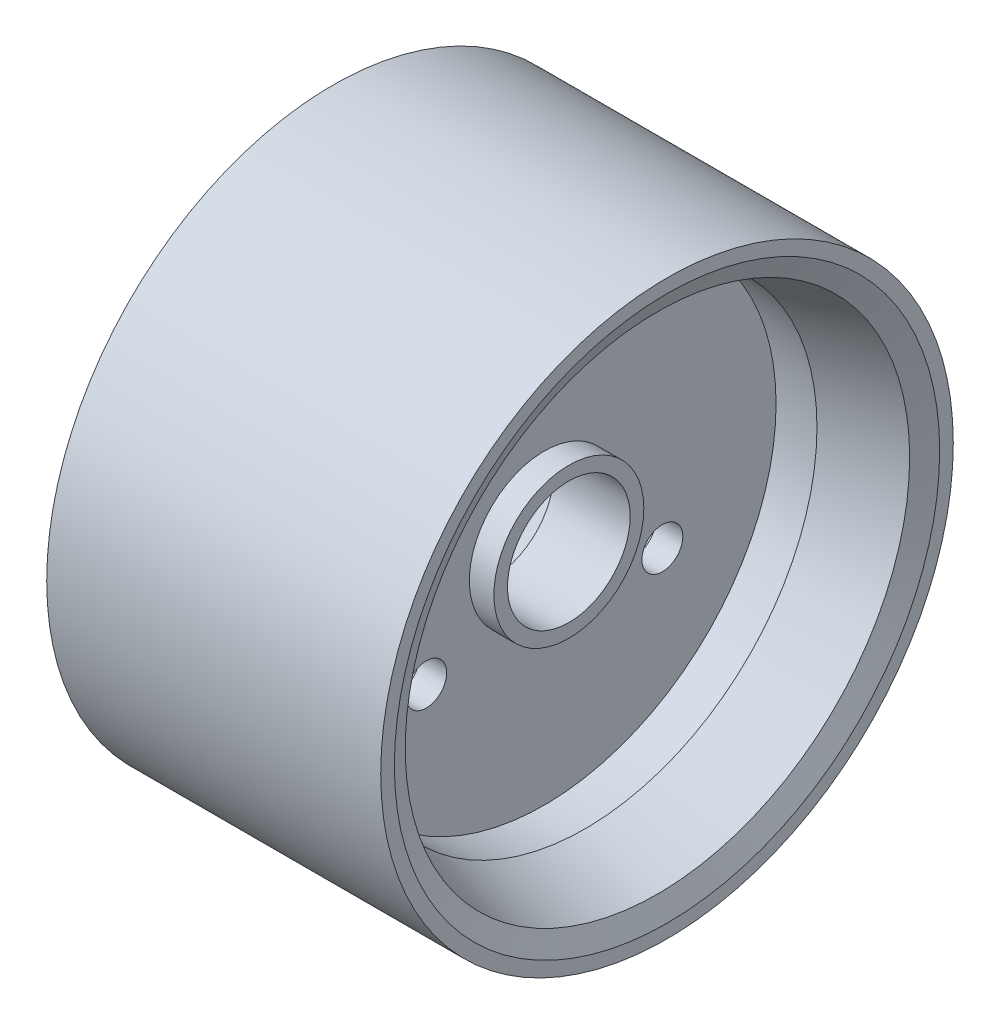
ISO-10303-21;
HEADER;
FILE_DESCRIPTION(('STEP AP214'),'2;1');
FILE_NAME('part.step','',(''),(''),'','','');
FILE_SCHEMA(('AUTOMOTIVE_DESIGN { 1 0 10303 214 1 1 1 1 }'));
ENDSEC;
DATA;
#1=APPLICATION_CONTEXT('core data for automotive mechanical design processes');
#2=APPLICATION_PROTOCOL_DEFINITION('international standard','automotive_design',2000,#1);
#3=PRODUCT_CONTEXT('',#1,'mechanical');
#4=PRODUCT('Part','Part','',(#3));
#5=PRODUCT_RELATED_PRODUCT_CATEGORY('part','',(#4));
#6=PRODUCT_DEFINITION_FORMATION('','',#4);
#7=PRODUCT_DEFINITION_CONTEXT('part definition',#1,'design');
#8=PRODUCT_DEFINITION('design','',#6,#7);
#9=PRODUCT_DEFINITION_SHAPE('','',#8);
#10=(LENGTH_UNIT() NAMED_UNIT(*) SI_UNIT(.MILLI.,.METRE.));
#11=(NAMED_UNIT(*) PLANE_ANGLE_UNIT() SI_UNIT($,.RADIAN.));
#12=(NAMED_UNIT(*) SI_UNIT($,.STERADIAN.) SOLID_ANGLE_UNIT());
#13=UNCERTAINTY_MEASURE_WITH_UNIT(LENGTH_MEASURE(1.E-05),#10,'distance_accuracy_value','');
#14=(GEOMETRIC_REPRESENTATION_CONTEXT(3) GLOBAL_UNCERTAINTY_ASSIGNED_CONTEXT((#13)) GLOBAL_UNIT_ASSIGNED_CONTEXT((#10,
#11,#12)) REPRESENTATION_CONTEXT('',''));
#15=CARTESIAN_POINT('',(0.,0.,0.));
#16=DIRECTION('',(0.,0.,1.));
#17=DIRECTION('',(1.,0.,0.));
#18=AXIS2_PLACEMENT_3D('',#15,#16,#17);
#19=CARTESIAN_POINT('',(-2.,5.5,0.));
#20=DIRECTION('',(-1.,0.,0.));
#21=DIRECTION('',(0.,0.,1.));
#22=AXIS2_PLACEMENT_3D('',#19,#20,#21);
#23=PLANE('',#22);
#24=CARTESIAN_POINT('',(-2.,-5.00000000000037,8.66025403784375));
#25=DIRECTION('',(1.,0.,0.));
#26=DIRECTION('',(0.,0.,-1.));
#27=AXIS2_PLACEMENT_3D('',#24,#25,#26);
#28=CIRCLE('',#27,1.5000000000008);
#29=CARTESIAN_POINT('',(-2.,-5.00000000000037,7.16025403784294));
#30=VERTEX_POINT('',#29);
#31=EDGE_CURVE('E96',#30,#30,#28,.T.);
#32=ORIENTED_EDGE('',*,*,#31,.T.);
#33=EDGE_LOOP('',(#32));
#34=FACE_BOUND('',#33,.T.);
#35=CARTESIAN_POINT('',(-2.,-4.99999999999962,-8.66025403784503));
#36=DIRECTION('',(1.,0.,0.));
#37=DIRECTION('',(0.,0.,-1.));
#38=AXIS2_PLACEMENT_3D('',#35,#36,#37);
#39=CIRCLE('',#38,1.50000000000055);
#40=CARTESIAN_POINT('',(-2.,-4.99999999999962,-10.1602540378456));
#41=VERTEX_POINT('',#40);
#42=EDGE_CURVE('E90',#41,#41,#39,.T.);
#43=ORIENTED_EDGE('',*,*,#42,.T.);
#44=EDGE_LOOP('',(#43));
#45=FACE_BOUND('',#44,.T.);
#46=CARTESIAN_POINT('',(-2.,10.,0.));
#47=DIRECTION('',(1.,0.,0.));
#48=DIRECTION('',(0.,0.,-1.));
#49=AXIS2_PLACEMENT_3D('',#46,#47,#48);
#50=CIRCLE('',#49,1.5);
#51=CARTESIAN_POINT('',(-2.,10.,-1.5));
#52=VERTEX_POINT('',#51);
#53=EDGE_CURVE('E86',#52,#52,#50,.T.);
#54=ORIENTED_EDGE('',*,*,#53,.T.);
#55=EDGE_LOOP('',(#54));
#56=FACE_BOUND('',#55,.T.);
#57=CARTESIAN_POINT('',(-1.99999999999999,0.,0.));
#58=DIRECTION('',(1.,0.,0.));
#59=DIRECTION('',(0.,0.,-1.));
#60=AXIS2_PLACEMENT_3D('',#57,#58,#59);
#61=CIRCLE('',#60,5.5);
#62=CARTESIAN_POINT('',(-1.99999999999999,0.,-5.5));
#63=VERTEX_POINT('',#62);
#64=EDGE_CURVE('E83',#63,#63,#61,.T.);
#65=ORIENTED_EDGE('',*,*,#64,.T.);
#66=EDGE_LOOP('',(#65));
#67=FACE_BOUND('',#66,.T.);
#68=CARTESIAN_POINT('',(-2.,0.,0.));
#69=DIRECTION('',(1.,0.,0.));
#70=DIRECTION('',(0.,0.,-1.));
#71=AXIS2_PLACEMENT_3D('',#68,#69,#70);
#72=CIRCLE('',#71,17.);
#73=CARTESIAN_POINT('',(-2.,0.,-17.));
#74=VERTEX_POINT('',#73);
#75=EDGE_CURVE('E10',#74,#74,#72,.T.);
#76=ORIENTED_EDGE('',*,*,#75,.F.);
#77=EDGE_LOOP('',(#76));
#78=FACE_BOUND('',#77,.T.);
#79=ADVANCED_FACE('F31',(#34,#45,#56,#67,#78),#23,.T.);
#80=CARTESIAN_POINT('',(18.3819196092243,0.,0.));
#81=DIRECTION('',(1.,0.,0.));
#82=DIRECTION('',(0.,0.,-1.));
#83=AXIS2_PLACEMENT_3D('',#80,#81,#82);
#84=CYLINDRICAL_SURFACE('',#83,17.);
#85=ORIENTED_EDGE('',*,*,#75,.T.);
#86=EDGE_LOOP('',(#85));
#87=FACE_BOUND('',#86,.T.);
#88=CARTESIAN_POINT('',(-9.5,0.,0.));
#89=DIRECTION('',(1.,0.,0.));
#90=DIRECTION('',(0.,0.,-1.));
#91=AXIS2_PLACEMENT_3D('',#88,#89,#90);
#92=CIRCLE('',#91,17.);
#93=CARTESIAN_POINT('',(-9.5,0.,-17.));
#94=VERTEX_POINT('',#93);
#95=EDGE_CURVE('E37',#94,#94,#92,.T.);
#96=ORIENTED_EDGE('',*,*,#95,.F.);
#97=EDGE_LOOP('',(#96));
#98=FACE_BOUND('',#97,.T.);
#99=ADVANCED_FACE('F160',(#87,#98),#84,.F.);
#100=CARTESIAN_POINT('',(-14.8,0.,0.));
#101=DIRECTION('',(-1.,0.,0.));
#102=DIRECTION('',(0.,0.,1.));
#103=AXIS2_PLACEMENT_3D('',#100,#101,#102);
#104=CONICAL_SURFACE('',#103,18.5,0.275805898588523);
#105=ORIENTED_EDGE('',*,*,#95,.T.);
#106=EDGE_LOOP('',(#105));
#107=FACE_BOUND('',#106,.T.);
#108=CARTESIAN_POINT('',(-14.8,0.,0.));
#109=DIRECTION('',(1.,0.,0.));
#110=DIRECTION('',(0.,0.,-1.));
#111=AXIS2_PLACEMENT_3D('',#108,#109,#110);
#112=CIRCLE('',#111,18.5);
#113=CARTESIAN_POINT('',(-14.8,0.,-18.5));
#114=VERTEX_POINT('',#113);
#115=EDGE_CURVE('E41',#114,#114,#112,.T.);
#116=ORIENTED_EDGE('',*,*,#115,.F.);
#117=EDGE_LOOP('',(#116));
#118=FACE_BOUND('',#117,.T.);
#119=ADVANCED_FACE('F164',(#107,#118),#104,.F.);
#120=CARTESIAN_POINT('',(-15.5,0.,0.));
#121=DIRECTION('',(-1.,0.,0.));
#122=DIRECTION('',(0.,0.,1.));
#123=AXIS2_PLACEMENT_3D('',#120,#121,#122);
#124=CONICAL_SURFACE('',#123,20.,1.13416916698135);
#125=ORIENTED_EDGE('',*,*,#115,.T.);
#126=EDGE_LOOP('',(#125));
#127=FACE_BOUND('',#126,.T.);
#128=CARTESIAN_POINT('',(-15.5,0.,0.));
#129=DIRECTION('',(1.,0.,0.));
#130=DIRECTION('',(0.,0.,-1.));
#131=AXIS2_PLACEMENT_3D('',#128,#129,#130);
#132=CIRCLE('',#131,20.);
#133=CARTESIAN_POINT('',(-15.5,0.,-20.));
#134=VERTEX_POINT('',#133);
#135=EDGE_CURVE('E45',#134,#134,#132,.T.);
#136=ORIENTED_EDGE('',*,*,#135,.F.);
#137=EDGE_LOOP('',(#136));
#138=FACE_BOUND('',#137,.T.);
#139=ADVANCED_FACE('F168',(#127,#138),#124,.F.);
#140=CARTESIAN_POINT('',(-15.5,20.,0.));
#141=DIRECTION('',(-1.,0.,0.));
#142=DIRECTION('',(0.,0.,1.));
#143=AXIS2_PLACEMENT_3D('',#140,#141,#142);
#144=PLANE('',#143);
#145=ORIENTED_EDGE('',*,*,#135,.T.);
#146=EDGE_LOOP('',(#145));
#147=FACE_BOUND('',#146,.T.);
#148=CARTESIAN_POINT('',(-15.5,0.,0.));
#149=DIRECTION('',(1.,0.,0.));
#150=DIRECTION('',(0.,0.,-1.));
#151=AXIS2_PLACEMENT_3D('',#148,#149,#150);
#152=CIRCLE('',#151,21.);
#153=CARTESIAN_POINT('',(-15.5,0.,-21.));
#154=VERTEX_POINT('',#153);
#155=EDGE_CURVE('E50',#154,#154,#152,.T.);
#156=ORIENTED_EDGE('',*,*,#155,.F.);
#157=EDGE_LOOP('',(#156));
#158=FACE_BOUND('',#157,.T.);
#159=ADVANCED_FACE('F174',(#147,#158),#144,.T.);
#160=CARTESIAN_POINT('',(18.3819196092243,0.,0.));
#161=DIRECTION('',(1.,0.,0.));
#162=DIRECTION('',(0.,0.,-1.));
#163=AXIS2_PLACEMENT_3D('',#160,#161,#162);
#164=CYLINDRICAL_SURFACE('',#163,21.);
#165=ORIENTED_EDGE('',*,*,#155,.T.);
#166=EDGE_LOOP('',(#165));
#167=FACE_BOUND('',#166,.T.);
#168=CARTESIAN_POINT('',(9.,0.,0.));
#169=DIRECTION('',(1.,0.,0.));
#170=DIRECTION('',(0.,0.,-1.));
#171=AXIS2_PLACEMENT_3D('',#168,#169,#170);
#172=CIRCLE('',#171,21.);
#173=CARTESIAN_POINT('',(9.,0.,-21.));
#174=VERTEX_POINT('',#173);
#175=EDGE_CURVE('E53',#174,#174,#172,.T.);
#176=ORIENTED_EDGE('',*,*,#175,.F.);
#177=EDGE_LOOP('',(#176));
#178=FACE_BOUND('',#177,.T.);
#179=ADVANCED_FACE('F178',(#167,#178),#164,.T.);
#180=CARTESIAN_POINT('',(9.,20.,0.));
#181=DIRECTION('',(1.,0.,0.));
#182=DIRECTION('',(0.,0.,-1.));
#183=AXIS2_PLACEMENT_3D('',#180,#181,#182);
#184=PLANE('',#183);
#185=ORIENTED_EDGE('',*,*,#175,.T.);
#186=EDGE_LOOP('',(#185));
#187=FACE_BOUND('',#186,.T.);
#188=CARTESIAN_POINT('',(9.,0.,0.));
#189=DIRECTION('',(1.,0.,0.));
#190=DIRECTION('',(0.,0.,-1.));
#191=AXIS2_PLACEMENT_3D('',#188,#189,#190);
#192=CIRCLE('',#191,20.);
#193=CARTESIAN_POINT('',(9.,0.,-20.));
#194=VERTEX_POINT('',#193);
#195=EDGE_CURVE('E56',#194,#194,#192,.T.);
#196=ORIENTED_EDGE('',*,*,#195,.F.);
#197=EDGE_LOOP('',(#196));
#198=FACE_BOUND('',#197,.T.);
#199=ADVANCED_FACE('F182',(#187,#198),#184,.T.);
#200=CARTESIAN_POINT('',(8.3,0.,0.));
#201=DIRECTION('',(1.,0.,0.));
#202=DIRECTION('',(0.,0.,-1.));
#203=AXIS2_PLACEMENT_3D('',#200,#201,#202);
#204=CONICAL_SURFACE('',#203,18.5,1.13416916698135);
#205=ORIENTED_EDGE('',*,*,#195,.T.);
#206=EDGE_LOOP('',(#205));
#207=FACE_BOUND('',#206,.T.);
#208=CARTESIAN_POINT('',(8.3,0.,0.));
#209=DIRECTION('',(1.,0.,0.));
#210=DIRECTION('',(0.,0.,-1.));
#211=AXIS2_PLACEMENT_3D('',#208,#209,#210);
#212=CIRCLE('',#211,18.5);
#213=CARTESIAN_POINT('',(8.3,0.,-18.5));
#214=VERTEX_POINT('',#213);
#215=EDGE_CURVE('E59',#214,#214,#212,.T.);
#216=ORIENTED_EDGE('',*,*,#215,.F.);
#217=EDGE_LOOP('',(#216));
#218=FACE_BOUND('',#217,.T.);
#219=ADVANCED_FACE('F186',(#207,#218),#204,.F.);
#220=CARTESIAN_POINT('',(3.,0.,0.));
#221=DIRECTION('',(1.,0.,0.));
#222=DIRECTION('',(0.,0.,-1.));
#223=AXIS2_PLACEMENT_3D('',#220,#221,#222);
#224=CONICAL_SURFACE('',#223,17.,0.275805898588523);
#225=ORIENTED_EDGE('',*,*,#215,.T.);
#226=EDGE_LOOP('',(#225));
#227=FACE_BOUND('',#226,.T.);
#228=CARTESIAN_POINT('',(3.,0.,0.));
#229=DIRECTION('',(1.,0.,0.));
#230=DIRECTION('',(0.,0.,-1.));
#231=AXIS2_PLACEMENT_3D('',#228,#229,#230);
#232=CIRCLE('',#231,17.);
#233=CARTESIAN_POINT('',(3.,0.,-17.));
#234=VERTEX_POINT('',#233);
#235=EDGE_CURVE('E62',#234,#234,#232,.T.);
#236=ORIENTED_EDGE('',*,*,#235,.F.);
#237=EDGE_LOOP('',(#236));
#238=FACE_BOUND('',#237,.T.);
#239=ADVANCED_FACE('F190',(#227,#238),#224,.F.);
#240=CARTESIAN_POINT('',(18.3819196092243,0.,0.));
#241=DIRECTION('',(1.,0.,0.));
#242=DIRECTION('',(0.,0.,-1.));
#243=AXIS2_PLACEMENT_3D('',#240,#241,#242);
#244=CYLINDRICAL_SURFACE('',#243,17.);
#245=ORIENTED_EDGE('',*,*,#235,.T.);
#246=EDGE_LOOP('',(#245));
#247=FACE_BOUND('',#246,.T.);
#248=CARTESIAN_POINT('',(0.,0.,0.));
#249=DIRECTION('',(1.,0.,0.));
#250=DIRECTION('',(0.,0.,-1.));
#251=AXIS2_PLACEMENT_3D('',#248,#249,#250);
#252=CIRCLE('',#251,17.);
#253=CARTESIAN_POINT('',(0.,0.,-17.));
#254=VERTEX_POINT('',#253);
#255=EDGE_CURVE('E65',#254,#254,#252,.T.);
#256=ORIENTED_EDGE('',*,*,#255,.F.);
#257=EDGE_LOOP('',(#256));
#258=FACE_BOUND('',#257,.T.);
#259=ADVANCED_FACE('F118',(#247,#258),#244,.F.);
#260=CARTESIAN_POINT('',(0.,5.5,0.));
#261=DIRECTION('',(1.,0.,0.));
#262=DIRECTION('',(0.,0.,-1.));
#263=AXIS2_PLACEMENT_3D('',#260,#261,#262);
#264=PLANE('',#263);
#265=CARTESIAN_POINT('',(0.,-5.00000000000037,8.66025403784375));
#266=DIRECTION('',(1.,0.,0.));
#267=DIRECTION('',(0.,0.,-1.));
#268=AXIS2_PLACEMENT_3D('',#265,#266,#267);
#269=CIRCLE('',#268,1.5000000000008);
#270=CARTESIAN_POINT('',(0.,-5.00000000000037,7.16025403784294));
#271=VERTEX_POINT('',#270);
#272=EDGE_CURVE('E99',#271,#271,#269,.T.);
#273=ORIENTED_EDGE('',*,*,#272,.F.);
#274=EDGE_LOOP('',(#273));
#275=FACE_BOUND('',#274,.T.);
#276=CARTESIAN_POINT('',(0.,-4.99999999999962,-8.66025403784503));
#277=DIRECTION('',(1.,0.,0.));
#278=DIRECTION('',(0.,0.,-1.));
#279=AXIS2_PLACEMENT_3D('',#276,#277,#278);
#280=CIRCLE('',#279,1.50000000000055);
#281=CARTESIAN_POINT('',(0.,-4.99999999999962,-10.1602540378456));
#282=VERTEX_POINT('',#281);
#283=EDGE_CURVE('E93',#282,#282,#280,.T.);
#284=ORIENTED_EDGE('',*,*,#283,.F.);
#285=EDGE_LOOP('',(#284));
#286=FACE_BOUND('',#285,.T.);
#287=CARTESIAN_POINT('',(0.,10.,0.));
#288=DIRECTION('',(1.,0.,0.));
#289=DIRECTION('',(0.,0.,-1.));
#290=AXIS2_PLACEMENT_3D('',#287,#288,#289);
#291=CIRCLE('',#290,1.5);
#292=CARTESIAN_POINT('',(0.,10.,-1.5));
#293=VERTEX_POINT('',#292);
#294=EDGE_CURVE('E87',#293,#293,#291,.T.);
#295=ORIENTED_EDGE('',*,*,#294,.F.);
#296=EDGE_LOOP('',(#295));
#297=FACE_BOUND('',#296,.T.);
#298=ORIENTED_EDGE('',*,*,#255,.T.);
#299=EDGE_LOOP('',(#298));
#300=FACE_BOUND('',#299,.T.);
#301=CARTESIAN_POINT('',(0.,0.,0.));
#302=DIRECTION('',(1.,0.,0.));
#303=DIRECTION('',(0.,0.,-1.));
#304=AXIS2_PLACEMENT_3D('',#301,#302,#303);
#305=CIRCLE('',#304,5.5);
#306=CARTESIAN_POINT('',(0.,0.,-5.5));
#307=VERTEX_POINT('',#306);
#308=EDGE_CURVE('E68',#307,#307,#305,.T.);
#309=ORIENTED_EDGE('',*,*,#308,.F.);
#310=EDGE_LOOP('',(#309));
#311=FACE_BOUND('',#310,.T.);
#312=ADVANCED_FACE('F114',(#275,#286,#297,#300,#311),#264,.T.);
#313=CARTESIAN_POINT('',(18.3819196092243,0.,0.));
#314=DIRECTION('',(1.,0.,0.));
#315=DIRECTION('',(0.,0.,-1.));
#316=AXIS2_PLACEMENT_3D('',#313,#314,#315);
#317=CYLINDRICAL_SURFACE('',#316,5.5);
#318=ORIENTED_EDGE('',*,*,#308,.T.);
#319=EDGE_LOOP('',(#318));
#320=FACE_BOUND('',#319,.T.);
#321=CARTESIAN_POINT('',(1.8,0.,0.));
#322=DIRECTION('',(1.,0.,0.));
#323=DIRECTION('',(0.,0.,-1.));
#324=AXIS2_PLACEMENT_3D('',#321,#322,#323);
#325=CIRCLE('',#324,5.5);
#326=CARTESIAN_POINT('',(1.8,0.,-5.5));
#327=VERTEX_POINT('',#326);
#328=EDGE_CURVE('E71',#327,#327,#325,.T.);
#329=ORIENTED_EDGE('',*,*,#328,.F.);
#330=EDGE_LOOP('',(#329));
#331=FACE_BOUND('',#330,.T.);
#332=ADVANCED_FACE('F117',(#320,#331),#317,.T.);
#333=CARTESIAN_POINT('',(1.8,5.5,0.));
#334=DIRECTION('',(1.,0.,0.));
#335=DIRECTION('',(0.,0.,-1.));
#336=AXIS2_PLACEMENT_3D('',#333,#334,#335);
#337=PLANE('',#336);
#338=ORIENTED_EDGE('',*,*,#328,.T.);
#339=EDGE_LOOP('',(#338));
#340=FACE_BOUND('',#339,.T.);
#341=CARTESIAN_POINT('',(1.8,0.,0.));
#342=DIRECTION('',(1.,0.,0.));
#343=DIRECTION('',(0.,0.,-1.));
#344=AXIS2_PLACEMENT_3D('',#341,#342,#343);
#345=CIRCLE('',#344,4.5);
#346=CARTESIAN_POINT('',(1.8,0.,-4.5));
#347=VERTEX_POINT('',#346);
#348=EDGE_CURVE('E74',#347,#347,#345,.T.);
#349=ORIENTED_EDGE('',*,*,#348,.F.);
#350=EDGE_LOOP('',(#349));
#351=FACE_BOUND('',#350,.T.);
#352=ADVANCED_FACE('F130',(#340,#351),#337,.T.);
#353=CARTESIAN_POINT('',(18.3819196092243,0.,0.));
#354=DIRECTION('',(1.,0.,0.));
#355=DIRECTION('',(0.,0.,-1.));
#356=AXIS2_PLACEMENT_3D('',#353,#354,#355);
#357=CYLINDRICAL_SURFACE('',#356,4.5);
#358=ORIENTED_EDGE('',*,*,#348,.T.);
#359=EDGE_LOOP('',(#358));
#360=FACE_BOUND('',#359,.T.);
#361=CARTESIAN_POINT('',(-3.8,0.,0.));
#362=DIRECTION('',(1.,0.,0.));
#363=DIRECTION('',(0.,0.,-1.));
#364=AXIS2_PLACEMENT_3D('',#361,#362,#363);
#365=CIRCLE('',#364,4.5);
#366=CARTESIAN_POINT('',(-3.8,0.,-4.5));
#367=VERTEX_POINT('',#366);
#368=EDGE_CURVE('E77',#367,#367,#365,.T.);
#369=ORIENTED_EDGE('',*,*,#368,.F.);
#370=EDGE_LOOP('',(#369));
#371=FACE_BOUND('',#370,.T.);
#372=ADVANCED_FACE('F136',(#360,#371),#357,.F.);
#373=CARTESIAN_POINT('',(-3.8,5.5,0.));
#374=DIRECTION('',(-1.,0.,0.));
#375=DIRECTION('',(0.,0.,1.));
#376=AXIS2_PLACEMENT_3D('',#373,#374,#375);
#377=PLANE('',#376);
#378=ORIENTED_EDGE('',*,*,#368,.T.);
#379=EDGE_LOOP('',(#378));
#380=FACE_BOUND('',#379,.T.);
#381=CARTESIAN_POINT('',(-3.8,0.,0.));
#382=DIRECTION('',(1.,0.,0.));
#383=DIRECTION('',(0.,0.,-1.));
#384=AXIS2_PLACEMENT_3D('',#381,#382,#383);
#385=CIRCLE('',#384,5.5);
#386=CARTESIAN_POINT('',(-3.8,0.,-5.5));
#387=VERTEX_POINT('',#386);
#388=EDGE_CURVE('E80',#387,#387,#385,.T.);
#389=ORIENTED_EDGE('',*,*,#388,.F.);
#390=EDGE_LOOP('',(#389));
#391=FACE_BOUND('',#390,.T.);
#392=ADVANCED_FACE('F142',(#380,#391),#377,.T.);
#393=CARTESIAN_POINT('',(18.3819196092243,0.,0.));
#394=DIRECTION('',(1.,0.,0.));
#395=DIRECTION('',(0.,0.,-1.));
#396=AXIS2_PLACEMENT_3D('',#393,#394,#395);
#397=CYLINDRICAL_SURFACE('',#396,5.5);
#398=ORIENTED_EDGE('',*,*,#388,.T.);
#399=EDGE_LOOP('',(#398));
#400=FACE_BOUND('',#399,.T.);
#401=ORIENTED_EDGE('',*,*,#64,.F.);
#402=EDGE_LOOP('',(#401));
#403=FACE_BOUND('',#402,.T.);
#404=ADVANCED_FACE('F148',(#400,#403),#397,.T.);
#405=CARTESIAN_POINT('',(-2.,10.,0.));
#406=DIRECTION('',(1.,0.,0.));
#407=DIRECTION('',(0.,0.,-1.));
#408=AXIS2_PLACEMENT_3D('',#405,#406,#407);
#409=CYLINDRICAL_SURFACE('',#408,1.5);
#410=ORIENTED_EDGE('',*,*,#53,.F.);
#411=EDGE_LOOP('',(#410));
#412=FACE_BOUND('',#411,.T.);
#413=ORIENTED_EDGE('',*,*,#294,.T.);
#414=EDGE_LOOP('',(#413));
#415=FACE_BOUND('',#414,.T.);
#416=ADVANCED_FACE('F154',(#412,#415),#409,.F.);
#417=CARTESIAN_POINT('',(-2.,-4.99999999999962,-8.66025403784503));
#418=DIRECTION('',(1.,0.,0.));
#419=DIRECTION('',(0.,0.,-1.));
#420=AXIS2_PLACEMENT_3D('',#417,#418,#419);
#421=CYLINDRICAL_SURFACE('',#420,1.50000000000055);
#422=ORIENTED_EDGE('',*,*,#42,.F.);
#423=EDGE_LOOP('',(#422));
#424=FACE_BOUND('',#423,.T.);
#425=ORIENTED_EDGE('',*,*,#283,.T.);
#426=EDGE_LOOP('',(#425));
#427=FACE_BOUND('',#426,.T.);
#428=ADVANCED_FACE('F110',(#424,#427),#421,.F.);
#429=CARTESIAN_POINT('',(-2.,-5.00000000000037,8.66025403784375));
#430=DIRECTION('',(1.,0.,0.));
#431=DIRECTION('',(0.,0.,-1.));
#432=AXIS2_PLACEMENT_3D('',#429,#430,#431);
#433=CYLINDRICAL_SURFACE('',#432,1.5000000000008);
#434=ORIENTED_EDGE('',*,*,#31,.F.);
#435=EDGE_LOOP('',(#434));
#436=FACE_BOUND('',#435,.T.);
#437=ORIENTED_EDGE('',*,*,#272,.T.);
#438=EDGE_LOOP('',(#437));
#439=FACE_BOUND('',#438,.T.);
#440=ADVANCED_FACE('F107',(#436,#439),#433,.F.);
#441=CLOSED_SHELL('',(#79,#99,#119,#139,#159,#179,#199,#219,#239,#259,#312,#332,#352,#372,#392,
#404,#416,#428,#440));
#442=MANIFOLD_SOLID_BREP('B2',#441);
#443=ADVANCED_BREP_SHAPE_REPRESENTATION('',(#18,#442),#14);
#444=SHAPE_DEFINITION_REPRESENTATION(#9,#443);
ENDSEC;
END-ISO-10303-21;
